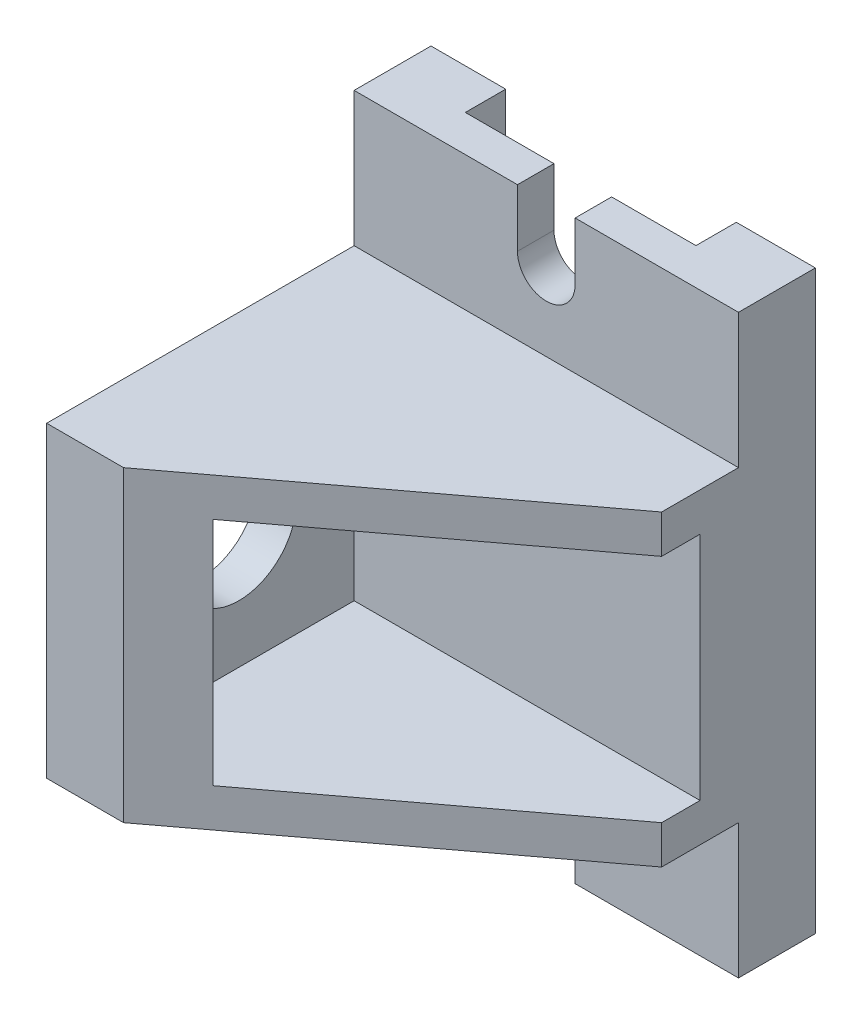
from build123d import *

# Parameters (mm, degrees)
CROQUIS1_W                 = 100
CROQUIS1_H                 = 150
SALIENTE_EXTRUIR1_DEPTH    = 10
CROQUIS2_W                 = 60
CROQUIS2_H                 = 21.008955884
CORTAR_EXTRUIR1_DEPTH      = 159.429795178
CORTAR_EXTRUIR2_DEPTH      = 93.330926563
CROQUIS4_W                 = 100
CROQUIS4_H                 = 80
SALIENTE_EXTRUIR2_DEPTH    = 80
CORTAR_EXTRUIR3_DEPTH      = 155.353490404
CORTAR_EXTRUIR4_DEPTH      = 128.377392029
CORTAR_EXTRUIR4_DEPTH_BACK = 40
CROQUIS6_W                 = 60
CROQUIS6_H                 = 60
CROQUIS7_R                 = 15
CORTAR_EXTRUIR5_DEPTH      = 40


with BuildPart() as part:
    # Croquis1 → Saliente-Extruir1 (new, symmetric)
    with BuildSketch(Plane.XY):
        Rectangle(CROQUIS1_W, CROQUIS1_H)
    extrude(amount=SALIENTE_EXTRUIR1_DEPTH, both=True)

    # Croquis2 → Cortar-Extruir1 (cut, through all)
    with BuildSketch(Plane.XZ.offset(75)):
        with Locations((-0.559996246, -10)):
            Rectangle(CROQUIS2_W, CROQUIS2_H)
    extrude(amount=-CORTAR_EXTRUIR1_DEPTH, mode=Mode.SUBTRACT)

    # Croquis3 → Cortar-Extruir2 (cut, through all)
    with BuildSketch(Plane.XY.offset(10)):
        with BuildLine():
            Line((-7.5, -60), (-7.5, -75))
            Line((-7.5, -75), (7.5, -75))
            Line((7.5, -75), (7.5, -60))
            ThreePointArc((7.5, -60), (0, -52.5), (-7.5, -60))
        make_face()
    cortar_extruir2 = extrude(amount=-CORTAR_EXTRUIR2_DEPTH, mode=Mode.SUBTRACT)

    # Simetr_a1: Cortar-Extruir2 across plane
    add(cortar_extruir2.mirror(Plane.ZX), mode=Mode.SUBTRACT)

    # Croquis4 → Saliente-Extruir2 (add)
    with BuildSketch(Plane.XY.offset(10)):
        Rectangle(CROQUIS4_W, CROQUIS4_H)
    extrude(amount=SALIENTE_EXTRUIR2_DEPTH)

    # Croquis5 → Cortar-Extruir3 (cut, through all)
    with BuildSketch(Plane.XZ.offset(40)):
        Polygon((-30, 90), (50, 30), (50, 90), align=None)
    extrude(amount=-CORTAR_EXTRUIR3_DEPTH, mode=Mode.SUBTRACT)

    # Croquis6 → Cortar-Extruir4 (cut, two sides: drawn at the far end of the back side and taken through both)
    with BuildSketch(Plane(origin=(0, 0, 0), x_dir=(0, 0, -1), z_dir=(1, 0, 0)).offset(-CORTAR_EXTRUIR4_DEPTH_BACK)):
        with Locations((-50, 0)):
            Rectangle(CROQUIS6_W, CROQUIS6_H)
    extrude(amount=CORTAR_EXTRUIR4_DEPTH + CORTAR_EXTRUIR4_DEPTH_BACK, mode=Mode.SUBTRACT)

    # Croquis7 → Cortar-Extruir5 (cut)
    with BuildSketch(Plane(origin=(-40, 0, 0), x_dir=(0, 0, -1), z_dir=(1, 0, 0))):
        with Locations((-50, 0)):
            Circle(CROQUIS7_R)
    extrude(amount=-CORTAR_EXTRUIR5_DEPTH, mode=Mode.SUBTRACT)


solid = part.part
